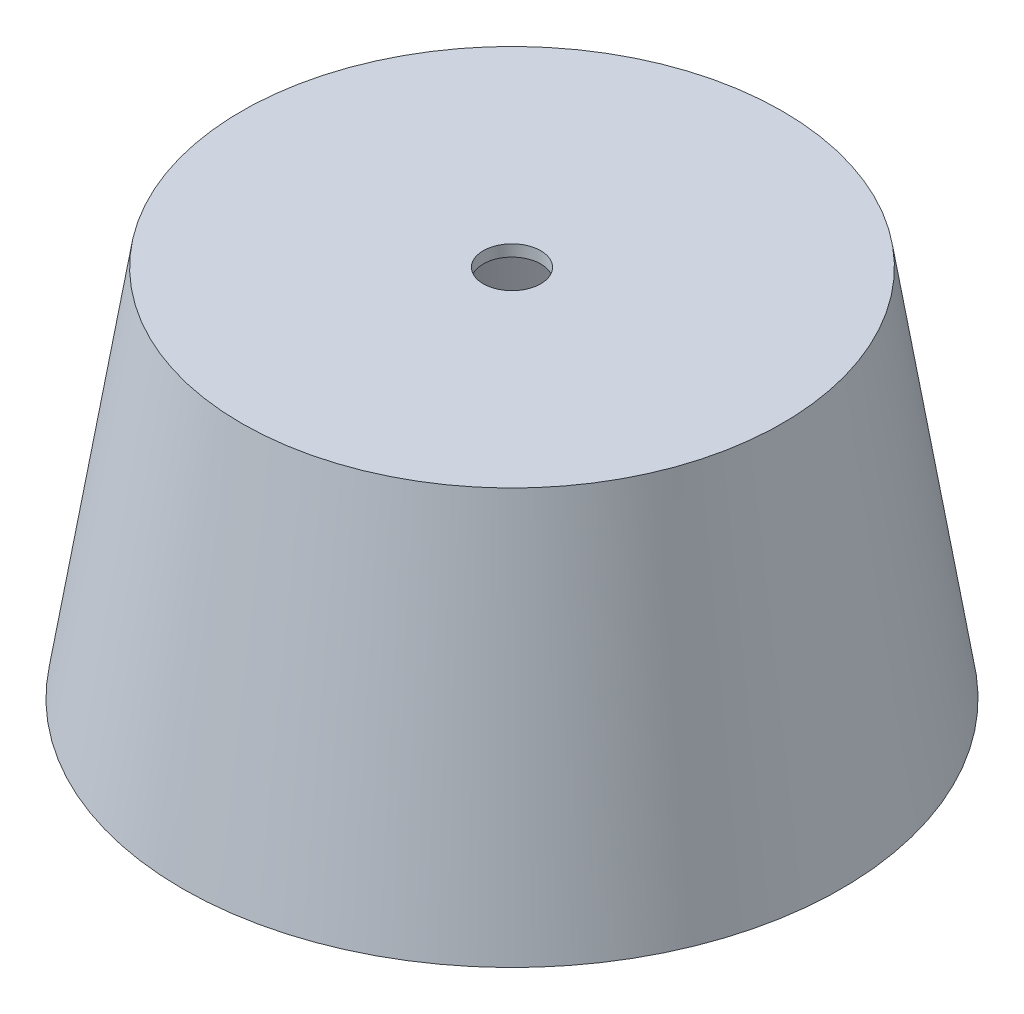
ISO-10303-21;
HEADER;
FILE_DESCRIPTION(('STEP AP214'),'2;1');
FILE_NAME('part.step','',(''),(''),'','','');
FILE_SCHEMA(('AUTOMOTIVE_DESIGN { 1 0 10303 214 1 1 1 1 }'));
ENDSEC;
DATA;
#1=APPLICATION_CONTEXT('core data for automotive mechanical design processes');
#2=APPLICATION_PROTOCOL_DEFINITION('international standard','automotive_design',2000,#1);
#3=PRODUCT_CONTEXT('',#1,'mechanical');
#4=PRODUCT('Part','Part','',(#3));
#5=PRODUCT_RELATED_PRODUCT_CATEGORY('part','',(#4));
#6=PRODUCT_DEFINITION_FORMATION('','',#4);
#7=PRODUCT_DEFINITION_CONTEXT('part definition',#1,'design');
#8=PRODUCT_DEFINITION('design','',#6,#7);
#9=PRODUCT_DEFINITION_SHAPE('','',#8);
#10=(LENGTH_UNIT() NAMED_UNIT(*) SI_UNIT(.MILLI.,.METRE.));
#11=(NAMED_UNIT(*) PLANE_ANGLE_UNIT() SI_UNIT($,.RADIAN.));
#12=(NAMED_UNIT(*) SI_UNIT($,.STERADIAN.) SOLID_ANGLE_UNIT());
#13=UNCERTAINTY_MEASURE_WITH_UNIT(LENGTH_MEASURE(1.E-05),#10,'distance_accuracy_value','');
#14=(GEOMETRIC_REPRESENTATION_CONTEXT(3) GLOBAL_UNCERTAINTY_ASSIGNED_CONTEXT((#13)) GLOBAL_UNIT_ASSIGNED_CONTEXT((#10,
#11,#12)) REPRESENTATION_CONTEXT('',''));
#15=CARTESIAN_POINT('',(0.,0.,0.));
#16=DIRECTION('',(0.,0.,1.));
#17=DIRECTION('',(1.,0.,0.));
#18=AXIS2_PLACEMENT_3D('',#15,#16,#17);
#19=CARTESIAN_POINT('',(-6.62874427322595,4.5241824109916,110.776782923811));
#20=DIRECTION('',(0.,-1.,0.));
#21=DIRECTION('',(-0.000898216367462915,0.,-0.999999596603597));
#22=AXIS2_PLACEMENT_3D('',#19,#20,#21);
#23=CONICAL_SURFACE('',#22,47.0685615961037,0.15707963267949);
#24=CARTESIAN_POINT('',(-6.62874427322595,-60.4758175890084,110.776782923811));
#25=DIRECTION('',(0.,-1.,0.));
#26=DIRECTION('',(-0.000898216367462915,0.,-0.999999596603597));
#27=AXIS2_PLACEMENT_3D('',#24,#25,#26);
#28=CIRCLE('',#27,57.3635502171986);
#29=CARTESIAN_POINT('',(-6.68026915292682,-60.4758175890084,53.4132558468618));
#30=VERTEX_POINT('',#29);
#31=EDGE_CURVE('E10',#30,#30,#28,.T.);
#32=ORIENTED_EDGE('',*,*,#31,.F.);
#33=EDGE_LOOP('',(#32));
#34=FACE_BOUND('',#33,.T.);
#35=CARTESIAN_POINT('',(-6.62874427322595,4.5241824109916,110.776782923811));
#36=DIRECTION('',(0.,-1.,0.));
#37=DIRECTION('',(-0.000898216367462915,0.,-0.999999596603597));
#38=AXIS2_PLACEMENT_3D('',#35,#36,#37);
#39=CIRCLE('',#38,47.0685615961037);
#40=CARTESIAN_POINT('',(-6.6710220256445,4.5241824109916,63.7082403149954));
#41=VERTEX_POINT('',#40);
#42=EDGE_CURVE('E47',#41,#41,#39,.T.);
#43=ORIENTED_EDGE('',*,*,#42,.T.);
#44=EDGE_LOOP('',(#43));
#45=FACE_BOUND('',#44,.T.);
#46=ADVANCED_FACE('F40',(#34,#45),#23,.T.);
#47=CARTESIAN_POINT('',(-6.62874427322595,-60.4758175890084,110.776782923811));
#48=DIRECTION('',(0.,-1.,0.));
#49=DIRECTION('',(-0.000898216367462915,0.,-0.999999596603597));
#50=AXIS2_PLACEMENT_3D('',#47,#48,#49);
#51=PLANE('',#50);
#52=CARTESIAN_POINT('',(-6.62874427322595,-60.4758175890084,110.776782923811));
#53=DIRECTION('',(0.,-1.,0.));
#54=DIRECTION('',(-0.000898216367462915,0.,-0.999999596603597));
#55=AXIS2_PLACEMENT_3D('',#52,#53,#54);
#56=CIRCLE('',#55,55.3386199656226);
#57=CARTESIAN_POINT('',(-6.67845032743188,-60.4758175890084,55.4381852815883));
#58=VERTEX_POINT('',#57);
#59=EDGE_CURVE('E52',#58,#58,#56,.T.);
#60=ORIENTED_EDGE('',*,*,#59,.F.);
#61=EDGE_LOOP('',(#60));
#62=FACE_BOUND('',#61,.T.);
#63=ORIENTED_EDGE('',*,*,#31,.T.);
#64=EDGE_LOOP('',(#63));
#65=FACE_BOUND('',#64,.T.);
#66=ADVANCED_FACE('F90',(#62,#65),#51,.T.);
#67=CARTESIAN_POINT('',(-6.62874427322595,4.5241824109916,110.776782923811));
#68=DIRECTION('',(0.,-1.,0.));
#69=DIRECTION('',(-0.000898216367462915,0.,-0.999999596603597));
#70=AXIS2_PLACEMENT_3D('',#67,#68,#69);
#71=PLANE('',#70);
#72=CARTESIAN_POINT('',(-6.62874427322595,4.5241824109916,110.776782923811));
#73=DIRECTION('',(0.,-1.,0.));
#74=DIRECTION('',(0.,0.,-1.));
#75=AXIS2_PLACEMENT_3D('',#72,#73,#74);
#76=CIRCLE('',#75,5.);
#77=CARTESIAN_POINT('',(-6.62874427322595,4.5241824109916,105.776782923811));
#78=VERTEX_POINT('',#77);
#79=EDGE_CURVE('E63',#78,#78,#76,.T.);
#80=ORIENTED_EDGE('',*,*,#79,.T.);
#81=EDGE_LOOP('',(#80));
#82=FACE_BOUND('',#81,.T.);
#83=ORIENTED_EDGE('',*,*,#42,.F.);
#84=EDGE_LOOP('',(#83));
#85=FACE_BOUND('',#84,.T.);
#86=ADVANCED_FACE('F83',(#82,#85),#71,.F.);
#87=CARTESIAN_POINT('',(-6.62874427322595,4.21131348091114,110.776782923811));
#88=DIRECTION('',(0.,-1.,0.));
#89=DIRECTION('',(-0.000898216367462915,0.,-0.999999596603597));
#90=AXIS2_PLACEMENT_3D('',#87,#88,#89);
#91=CONICAL_SURFACE('',#90,45.0931849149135,0.15707963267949);
#92=ORIENTED_EDGE('',*,*,#59,.T.);
#93=EDGE_LOOP('',(#92));
#94=FACE_BOUND('',#93,.T.);
#95=CARTESIAN_POINT('',(-6.62874427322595,2.5241824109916,110.776782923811));
#96=DIRECTION('',(0.,-1.,0.));
#97=DIRECTION('',(-0.000898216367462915,0.,-0.999999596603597));
#98=AXIS2_PLACEMENT_3D('',#95,#96,#97);
#99=CIRCLE('',#98,45.3604002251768);
#100=CARTESIAN_POINT('',(-6.66948772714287,2.5241824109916,65.4164009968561));
#101=VERTEX_POINT('',#100);
#102=EDGE_CURVE('E57',#101,#101,#99,.T.);
#103=ORIENTED_EDGE('',*,*,#102,.F.);
#104=EDGE_LOOP('',(#103));
#105=FACE_BOUND('',#104,.T.);
#106=ADVANCED_FACE('F78',(#94,#105),#91,.F.);
#107=CARTESIAN_POINT('',(-6.62874427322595,2.5241824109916,110.776782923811));
#108=DIRECTION('',(0.,-1.,0.));
#109=DIRECTION('',(-0.000898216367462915,0.,-0.999999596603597));
#110=AXIS2_PLACEMENT_3D('',#107,#108,#109);
#111=PLANE('',#110);
#112=CARTESIAN_POINT('',(-6.62874427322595,2.5241824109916,110.776782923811));
#113=DIRECTION('',(0.,-1.,0.));
#114=DIRECTION('',(0.,0.,-1.));
#115=AXIS2_PLACEMENT_3D('',#112,#113,#114);
#116=CIRCLE('',#115,5.);
#117=CARTESIAN_POINT('',(-6.62874427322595,2.5241824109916,105.776782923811));
#118=VERTEX_POINT('',#117);
#119=EDGE_CURVE('E67',#118,#118,#116,.T.);
#120=ORIENTED_EDGE('',*,*,#119,.F.);
#121=EDGE_LOOP('',(#120));
#122=FACE_BOUND('',#121,.T.);
#123=ORIENTED_EDGE('',*,*,#102,.T.);
#124=EDGE_LOOP('',(#123));
#125=FACE_BOUND('',#124,.T.);
#126=ADVANCED_FACE('F75',(#122,#125),#111,.T.);
#127=CARTESIAN_POINT('',(-6.62874427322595,12.5241824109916,110.776782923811));
#128=DIRECTION('',(0.,-1.,0.));
#129=DIRECTION('',(0.,0.,-1.));
#130=AXIS2_PLACEMENT_3D('',#127,#128,#129);
#131=CYLINDRICAL_SURFACE('',#130,5.);
#132=ORIENTED_EDGE('',*,*,#119,.T.);
#133=EDGE_LOOP('',(#132));
#134=FACE_BOUND('',#133,.T.);
#135=ORIENTED_EDGE('',*,*,#79,.F.);
#136=EDGE_LOOP('',(#135));
#137=FACE_BOUND('',#136,.T.);
#138=ADVANCED_FACE('F72',(#134,#137),#131,.F.);
#139=CLOSED_SHELL('',(#46,#66,#86,#106,#126,#138));
#140=MANIFOLD_SOLID_BREP('B2',#139);
#141=ADVANCED_BREP_SHAPE_REPRESENTATION('',(#18,#140),#14);
#142=SHAPE_DEFINITION_REPRESENTATION(#9,#141);
ENDSEC;
END-ISO-10303-21;
